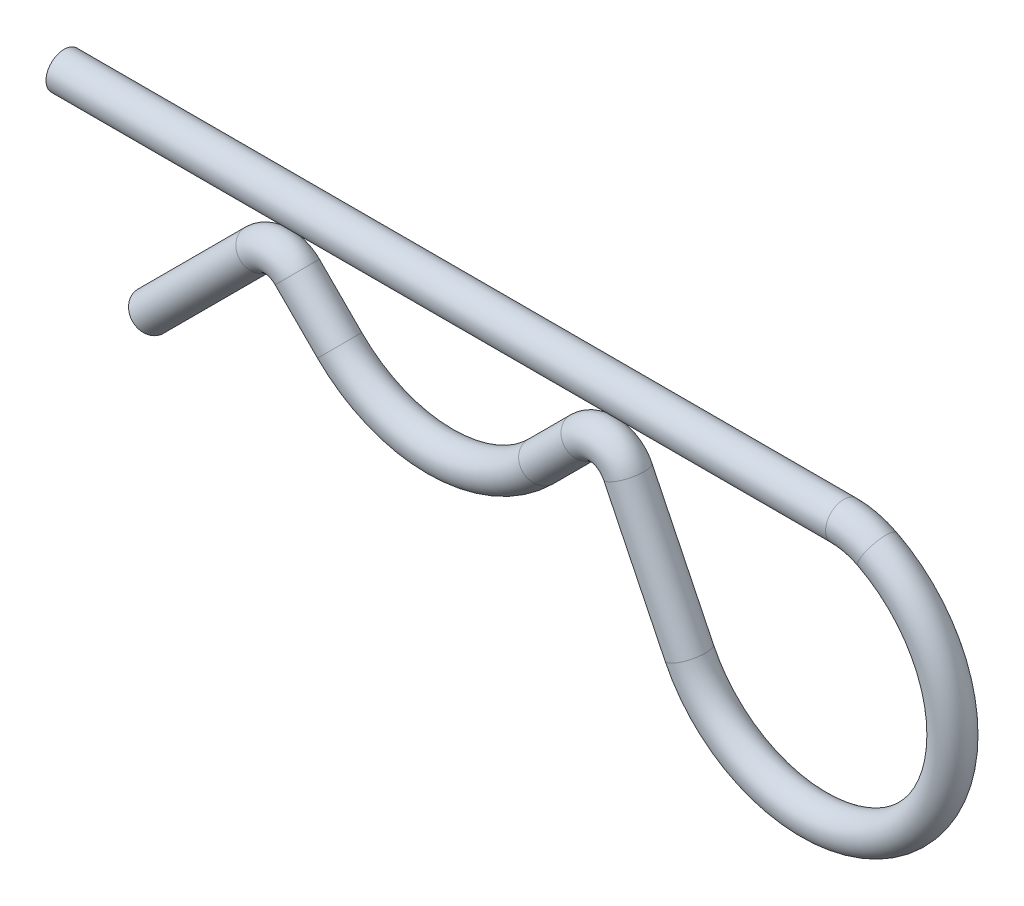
from build123d import *

# Parameters (mm, degrees)
ESQUISSE2_R = 1.25


with BuildPart() as part:
    # Balayage1: sweep along a path in Esquisse1
    with BuildLine(Plane.XY) as balayage1_path:
        Line((-26, -0.079787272), (27.889007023, -0.079787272))
        ThreePointArc((27.889007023, -0.079787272), (29.067518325, -0.220660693), (30.17962126, -0.635342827))
        ThreePointArc((30.17962126, -0.635342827), (32.467420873, -15.87396439), (17.285331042, -13.236965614))
        Line((17.285331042, -13.236965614), (13.035563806, -4.504591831))
        ThreePointArc((13.035563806, -4.504591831), (11.568165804, -3.407358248), (9.823008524, -3.96557371))
        Line((9.823008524, -3.96557371), (6.894291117, -6.894291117))
        ThreePointArc((6.894291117, -6.894291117), (0, -9.75), (-6.894291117, -6.894291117))
        Line((-6.894291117, -6.894291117), (-9.823008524, -3.96557371))
        ThreePointArc((-9.823008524, -3.96557371), (-11.237222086, -3.379787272), (-12.651435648, -3.96557371))
        Line((-12.651435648, -3.96557371), (-20.069621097, -11.383759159))
    # Esquisse2 → Balayage1 (sweep)
    with BuildSketch(Plane(origin=(-26, -0.079787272, 0), x_dir=(0, 0, 1), z_dir=(-1, 0, 0))):
        with Locations((0, 0.079787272)):
            Circle(ESQUISSE2_R)
    sweep(path=balayage1_path.line)


solid = part.part
